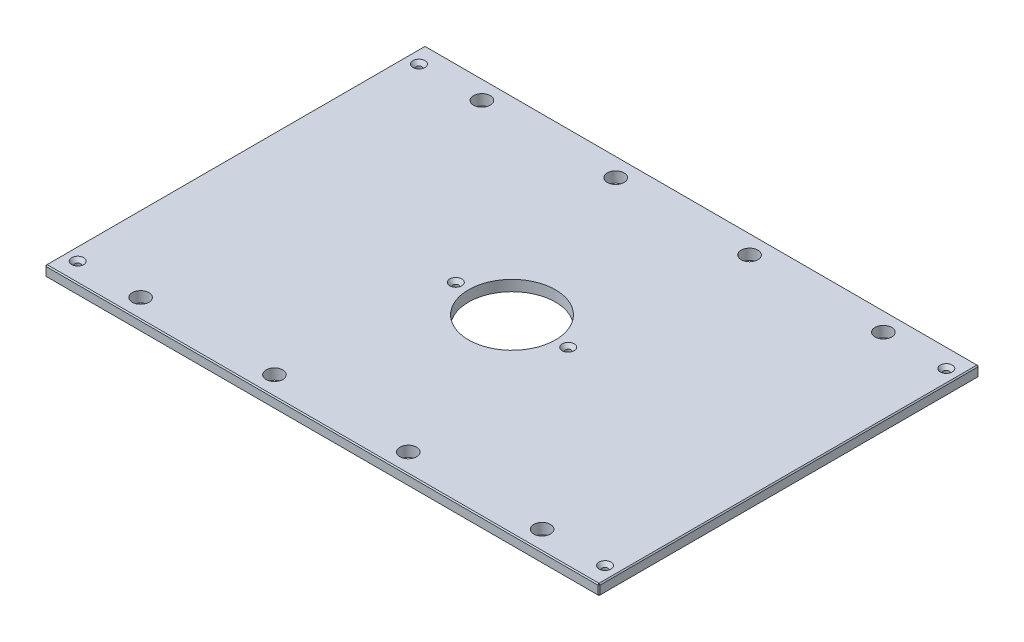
from build123d import *

# Parameters (mm, degrees)
SKETCH1_W                                        = 657.225
SKETCH1_H                                        = 450.85
BOSS_EXTRUDE1_DEPTH                              = 12.7
SKETCH13_R                                       = 51.562
CUT_EXTRUDE6_DEPTH                               = 399.702766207
F_25_32_0_78125_DIAMETER_HOLE1_D                 = 19.84375
CHAMFER2_SIZE                                    = 1.27
CSK_FOR_1_4_FLAT_HEAD_MACHINE_SCREW1_D           = 6.7564
CSK_FOR_1_4_FLAT_HEAD_MACHINE_SCREW1_CSINK_D     = 14.2748
CSK_FOR_1_4_FLAT_HEAD_MACHINE_SCREW1_CSINK_ANGLE = 82


with BuildPart() as part:
    # Sketch1 → Boss-Extrude1 (new body)
    with BuildSketch(Plane(origin=(0, 0, 0), x_dir=(1, 0, 0), z_dir=(0, 1, 0))):
        Rectangle(SKETCH1_W, SKETCH1_H)
    extrude(amount=BOSS_EXTRUDE1_DEPTH)

    # Sketch13 → Cut-Extrude6 (cut, through all)
    with BuildSketch(Plane(origin=(0, 12.7, 0), x_dir=(1, 0, 0), z_dir=(0, 1, 0))):
        with Locations(Location((0, 0, 0), (0, 0, 270))):
            Circle(SKETCH13_R)
    extrude(amount=-CUT_EXTRUDE6_DEPTH, mode=Mode.SUBTRACT)

    # 25_32 _0.78125_ Diameter Hole1 (through all)
    with Locations(Plane(origin=(0, 12.7, 0), x_dir=(1, 0, 0), z_dir=(0, 1, 0))):
        with Locations((238.125, 202.40498), (-238.125, 202.40498), (238.125, -202.40498), (-238.125, -202.40498), (-79.375, 202.40498), (79.375, 202.40498), (79.375, -202.40498), (-79.375, -202.40498)):
            Hole(F_25_32_0_78125_DIAMETER_HOLE1_D / 2)

    # Chamfer2
    chamfer2_edges = [part.edges().sort_by_distance(p)[0] for p in [
        (328.6125, 12.7, 0),
        (0, 12.7, -225.425),
        (-328.6125, 12.7, 0),
        (0, 0, -225.425),
        (328.6125, 0, 0),
        (0, 0, 225.425),
        (-328.6125, 0, 0),
        (0, 12.7, 225.425),
        (-328.6125, 6.35, -225.425),
        (328.6125, 6.35, -225.425),
        (328.6125, 6.35, 225.425),
        (-328.6125, 6.35, 225.425),
    ]]
    chamfer(chamfer2_edges, length=CHAMFER2_SIZE)

    # CSK for 1_4 Flat Head Machine Screw1 (through all)
    with Locations(Plane(origin=(0, 12.7, 0), x_dir=(1, 0, 0), z_dir=(0, 1, 0))):
        with Locations((312.7375, 202.40498), (312.7375, -202.40498), (-312.7375, -202.40498), (-66.675, 0), (66.675, 0), (-312.7375, 202.40498), (-238.125, 202.40498), (-238.125, -202.40498)):
            CounterSinkHole(CSK_FOR_1_4_FLAT_HEAD_MACHINE_SCREW1_D / 2, CSK_FOR_1_4_FLAT_HEAD_MACHINE_SCREW1_CSINK_D / 2, counter_sink_angle=CSK_FOR_1_4_FLAT_HEAD_MACHINE_SCREW1_CSINK_ANGLE)


solid = part.part
